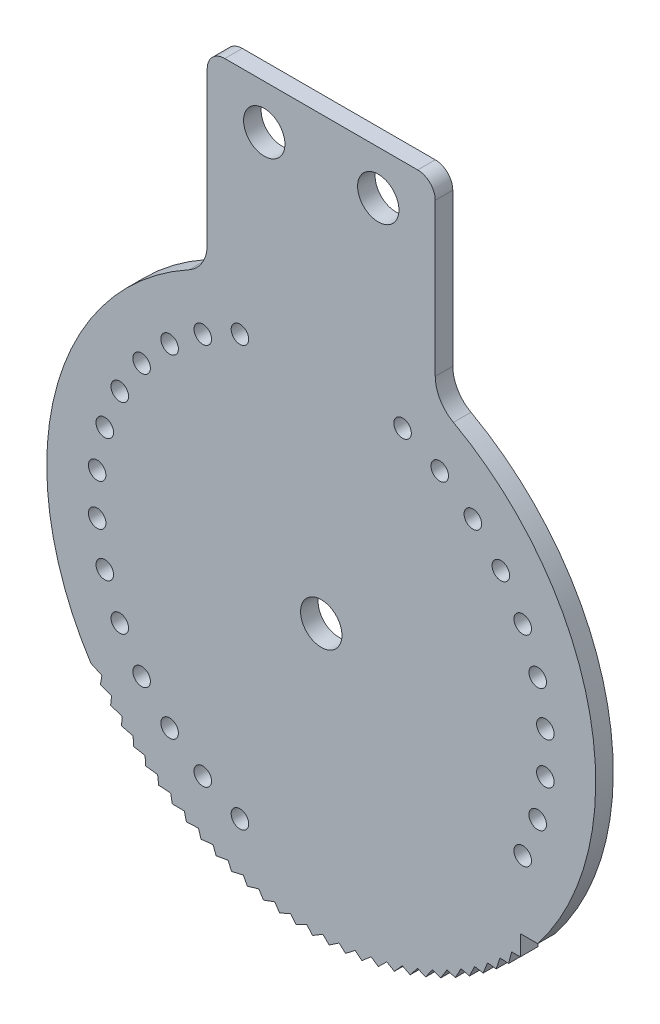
from build123d import *

# Parameters (mm, degrees)
SKETCH1_R           = 1.27
SKETCH1_R_2         = 2.992510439
BOSS_EXTRUDE1_DEPTH = 2.54


with BuildPart() as part:
    # Sketch1 → Boss-Extrude1 (new body)
    with BuildSketch(Plane.XY):
        with BuildLine():
            ThreePointArc((19.509856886, 24.03419173), (17.58421569, 25.899930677), (16.876629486, 28.486124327))
            Line((16.876629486, 28.486124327), (16.876629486, 50.556935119))
            ThreePointArc((16.876629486, 50.556935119), (16.13268071, 52.352986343), (14.336629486, 53.096935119))
            Line((14.336629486, 53.096935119), (-13.589044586, 53.096935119))
            ThreePointArc((-13.589044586, 53.096935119), (-15.38509581, 52.352986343), (-16.129044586, 50.556935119))
            Line((-16.129044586, 50.556935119), (-16.129044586, 28.486124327))
            ThreePointArc((-16.129044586, 28.486124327), (-16.836630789, 25.899930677), (-18.762271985, 24.03419173))
            ThreePointArc((-18.762271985, 24.03419173), (-38.156622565, -1.093379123), (-32.957568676, -32.406403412))
            Line((-32.957568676, -32.406403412), (-31.375238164, -33.129378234))
            Line((-31.375238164, -33.129378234), (-31.59434266, -34.371981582))
            Line((-31.59434266, -34.371981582), (-29.971391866, -34.998474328))
            Line((-29.971391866, -34.998474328), (-30.115360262, -36.252006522))
            Line((-30.115360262, -36.252006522), (-28.457665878, -36.779748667))
            Line((-28.457665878, -36.779748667), (-28.525976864, -38.039670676))
            Line((-28.525976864, -38.039670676), (-26.83954139, -38.466751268))
            Line((-26.83954139, -38.466751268), (-26.831947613, -39.728500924))
            Line((-26.831947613, -39.728500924), (-25.122877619, -40.053373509))
            Line((-25.122877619, -40.053373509), (-25.039406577, -41.312382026))
            Line((-25.039406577, -41.312382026), (-23.313890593, -41.533870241))
            Line((-23.313890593, -41.533870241), (-23.154844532, -42.785578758))
            Line((-23.154844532, -42.785578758), (-21.419130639, -42.902880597))
            Line((-21.419130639, -42.902880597), (-21.185085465, -44.142756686))
            Line((-21.185085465, -44.142756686), (-19.44545867, -44.1554474))
            Line((-19.44545867, -44.1554474), (-19.137261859, -45.379001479))
            Line((-19.137261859, -45.379001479), (-17.400021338, -45.287035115))
            Line((-17.400021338, -45.287035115), (-17.018788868, -46.489836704))
            Line((-17.018788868, -46.489836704), (-15.290225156, -46.293546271))
            Line((-15.290225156, -46.293546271), (-14.837337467, -47.471240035))
            Line((-14.837337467, -47.471240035), (-13.123709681, -47.171336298))
            Line((-13.123709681, -47.171336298), (-12.600806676, -48.319657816))
            Line((-12.600806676, -48.319657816), (-10.908319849, -47.917226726))
            Line((-10.908319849, -47.917226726), (-10.317294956, -49.032017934))
            Line((-10.317294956, -49.032017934), (-8.652077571, -48.52851669))
            Line((-8.652077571, -48.52851669), (-7.995070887, -49.605740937))
            Line((-7.995070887, -49.605740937), (-6.363152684, -49.002992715))
            Line((-6.363152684, -49.002992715), (-5.642543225, -50.038749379))
            Line((-5.642543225, -50.038749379), (-4.049833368, -49.338936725))
            Line((-4.049833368, -49.338936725), (-3.268230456, -50.32947534))
            Line((-3.268230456, -50.32947534), (-1.720496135, -49.53513227))
            Line((-1.720496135, -49.53513227), (-0.880729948, -50.476866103))
            Line((-0.880729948, -50.476866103), (0.616424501, -49.590868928))
            Line((0.616424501, -49.590868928), (1.511313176, -50.480387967))
            Line((1.511313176, -50.480387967), (2.952466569, -49.505944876))
            Line((2.952466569, -49.505944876), (3.899237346, -50.340028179))
            Line((3.899237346, -50.340028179), (5.279171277, -49.280667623))
            Line((5.279171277, -49.280667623), (6.274395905, -50.056294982))
            Line((6.274395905, -50.056294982), (7.588113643, -48.915852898))
            Line((7.588113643, -48.915852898), (8.628188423, -49.63021577))
            Line((8.628188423, -49.63021577), (9.870933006, -48.412821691))
            Line((9.870933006, -48.412821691), (10.952091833, -49.063333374))
            Line((10.952091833, -49.063333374), (12.119363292, -47.773395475))
            Line((12.119363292, -47.773395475), (13.237691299, -48.357700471))
            Line((13.237691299, -48.357700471), (14.325262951, -46.999889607))
            Line((14.325262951, -46.999889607), (15.476710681, -47.515872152))
            Line((15.476710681, -47.515872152), (16.480644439, -46.095104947))
            Line((16.480644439, -46.095104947), (17.661042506, -46.540896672))
            Line((17.661042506, -46.540896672), (18.577703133, -45.062317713))
            Line((18.577703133, -45.062317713), (19.782777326, -45.436304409))
            Line((19.782777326, -45.436304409), (20.608845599, -43.90526762))
            Line((20.608845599, -43.90526762), (21.834232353, -44.206095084))
            Line((21.834232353, -44.206095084), (22.566717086, -42.628144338))
            Line((22.566717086, -42.628144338), (23.807979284, -42.854723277))
            Line((23.807979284, -42.854723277), (24.444228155, -41.235572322))
            Line((24.444228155, -41.235572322), (25.696871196, -41.387082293))
            Line((25.696871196, -41.387082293), (26.234580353, -39.732594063))
            Line((26.234580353, -39.732594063), (27.494068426, -39.808486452))
            Line((27.494068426, -39.808486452), (27.931290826, -38.124651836))
            Line((27.931290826, -38.124651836), (29.193063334, -38.124651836))
            Line((29.193063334, -38.124651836), (29.193063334, -35.211714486))
            Line((29.193063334, -35.211714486), (31.707406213, -35.211714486))
            ThreePointArc((31.707406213, -35.211714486), (39.288011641, -2.772450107), (19.509856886, 24.03419173))
        make_face()
        with Locations((-21.573344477, -34.819834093)):
            Circle(SKETCH1_R, mode=Mode.SUBTRACT)
        with Locations((-25.623397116, -30.377137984)):
            Circle(SKETCH1_R, mode=Mode.SUBTRACT)
        with Locations((-28.788146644, -25.265891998)):
            Circle(SKETCH1_R, mode=Mode.SUBTRACT)
        with Locations((-16.775908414, -38.44268964)):
            Circle(SKETCH1_R, mode=Mode.SUBTRACT)
        with Locations((-11.394459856, -41.122332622)):
            Circle(SKETCH1_R, mode=Mode.SUBTRACT)
        with Locations((-30.959821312, -19.660153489)):
            Circle(SKETCH1_R, mode=Mode.SUBTRACT)
        with Locations((-32.064467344, -13.750819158)):
            Circle(SKETCH1_R, mode=Mode.SUBTRACT)
        with Locations((-32.064467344, -7.739124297)):
            Circle(SKETCH1_R, mode=Mode.SUBTRACT)
        with Locations((-30.959821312, -1.829789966)):
            Circle(SKETCH1_R, mode=Mode.SUBTRACT)
        with Locations((29.535731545, -25.265891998)):
            Circle(SKETCH1_R, mode=Mode.SUBTRACT)
        with Locations((0.37379245, -10.744971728)):
            Circle(SKETCH1_R_2, mode=Mode.SUBTRACT)
        with Locations((31.707406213, -19.660153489)):
            Circle(SKETCH1_R, mode=Mode.SUBTRACT)
        with Locations((32.812052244, -13.750819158)):
            Circle(SKETCH1_R, mode=Mode.SUBTRACT)
        with Locations((32.812052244, -7.739124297)):
            Circle(SKETCH1_R, mode=Mode.SUBTRACT)
        with Locations((31.707406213, -1.829789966)):
            Circle(SKETCH1_R, mode=Mode.SUBTRACT)
        with Locations((-28.788146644, 3.775948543)):
            Circle(SKETCH1_R, mode=Mode.SUBTRACT)
        with Locations((-25.623397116, 8.887194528)):
            Circle(SKETCH1_R, mode=Mode.SUBTRACT)
        with Locations((-21.573344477, 13.329890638)):
            Circle(SKETCH1_R, mode=Mode.SUBTRACT)
        with Locations((-16.775908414, 16.952746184)):
            Circle(SKETCH1_R, mode=Mode.SUBTRACT)
        with Locations((-11.394459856, 19.632389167)):
            Circle(SKETCH1_R, mode=Mode.SUBTRACT)
        with Locations((-7.877626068, 46.708526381)):
            Circle(SKETCH1_R_2, mode=Mode.SUBTRACT)
        with Locations((12.142044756, 19.632389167)):
            Circle(SKETCH1_R, mode=Mode.SUBTRACT)
        with Locations((17.523493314, 16.952746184)):
            Circle(SKETCH1_R, mode=Mode.SUBTRACT)
        with Locations((29.535731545, 3.775948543)):
            Circle(SKETCH1_R, mode=Mode.SUBTRACT)
        with Locations((22.320929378, 13.329890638)):
            Circle(SKETCH1_R, mode=Mode.SUBTRACT)
        with Locations((26.370982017, 8.887194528)):
            Circle(SKETCH1_R, mode=Mode.SUBTRACT)
        with Locations((8.625210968, 46.708526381)):
            Circle(SKETCH1_R_2, mode=Mode.SUBTRACT)
    extrude(amount=BOSS_EXTRUDE1_DEPTH)


solid = part.part
